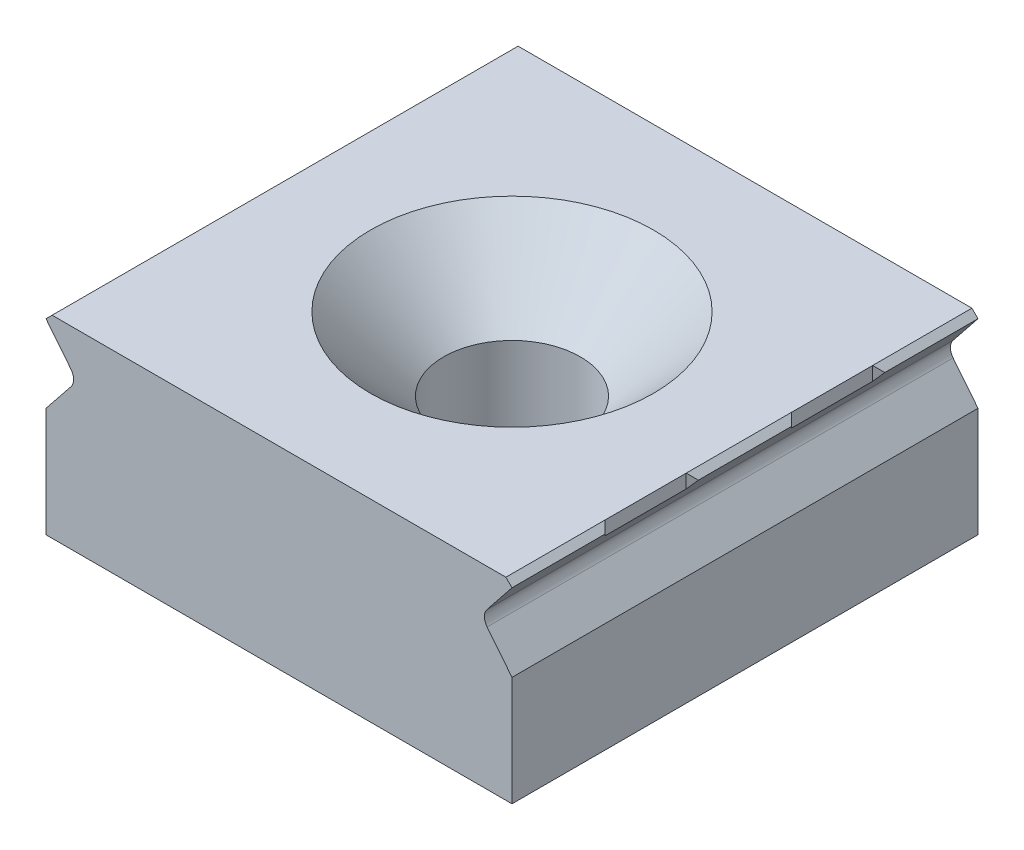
from build123d import *

# Parameters (mm, degrees)
SKETCH1_W           = 19.1
SKETCH1_H           = 19.1
BOSS_EXTRUDE1_DEPTH = 3.96
CHAMFER1_SIZE       = 0.25
CUT_EXTRUDE1_DEPTH  = 19.1
CUT_EXTRUDE2_DEPTH  = 1
LPATTERN1_COUNT     = 2
LPATTERN1_PITCH     = 7.64
SKETCH4_R           = 2.8
CUT_EXTRUDE3_DEPTH  = 7.92
CHAMFER2_SIZE       = 3


with BuildPart() as part:
    # Sketch1 → Boss-Extrude1 (new, symmetric)
    with BuildSketch(Plane(origin=(0, 0, 0), x_dir=(1, 0, 0), z_dir=(0, 1, 0))):
        Rectangle(SKETCH1_W, SKETCH1_H)
    extrude(amount=BOSS_EXTRUDE1_DEPTH, both=True)

    # Chamfer1
    chamfer1_edges = [part.edges().sort_by_distance(p)[0] for p in [
        (9.55, 3.96, 0),
        (-9.55, 3.96, 0),
    ]]
    chamfer(chamfer1_edges, length=CHAMFER1_SIZE)

    # Sketch2 → Cut-Extrude1 (cut)
    with BuildSketch(Plane.XY.offset(9.55)):
        with BuildLine():
            Line((-9.55, 3.71), (-9.55, 0.53))
            Line((-9.55, 0.53), (-8.529245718, 1.807952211))
            ThreePointArc((-8.529245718, 1.807952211), (-8.419919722, 2.12), (-8.529245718, 2.432047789))
            Line((-8.529245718, 2.432047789), (-9.55, 3.71))
        make_face()
    cut_extrude1 = extrude(amount=-CUT_EXTRUDE1_DEPTH, mode=Mode.SUBTRACT)

    # Mirror1: Cut-Extrude1 across plane
    add(cut_extrude1.mirror(Plane(origin=(0, 0, 0), x_dir=(0, 0, 1), z_dir=(1, 0, 0))), mode=Mode.SUBTRACT)

    # Sketch3 → Cut-Extrude2 (cut)
    with BuildSketch(Plane(origin=(0, 3.96, 0), x_dir=(1, 0, 0), z_dir=(0, 1, 0))):
        Polygon((-9.55, -5.73), (-9.55, -1.91), (-9.3, -2.16), (-9.3, -5.48), align=None)
        Polygon((9.55, -5.73), (9.3, -5.47999989), (9.3, -2.15999989), (9.55, -1.91), align=None)
    cut_extrude2 = extrude(amount=-CUT_EXTRUDE2_DEPTH, mode=Mode.SUBTRACT)

    # LPattern1: Cut-Extrude2 ×2
    with Locations(*[(0, 0, -i * LPATTERN1_PITCH) for i in range(1, LPATTERN1_COUNT)]):
        add(cut_extrude2, mode=Mode.SUBTRACT)

    # Sketch4 → Cut-Extrude3 (cut)
    with BuildSketch(Plane(origin=(0, 3.96, 0), x_dir=(1, 0, 0), z_dir=(0, 1, 0))):
        with Locations(Location((0, 0, 0), (0, 0, 270))):
            Circle(SKETCH4_R)
    extrude(amount=-CUT_EXTRUDE3_DEPTH, mode=Mode.SUBTRACT)

    # Chamfer2
    chamfer2_edges = [part.edges().sort_by_distance(p)[0] for p in [
        (0, 3.96, -2.8),
    ]]
    chamfer(chamfer2_edges, length=CHAMFER2_SIZE)


solid = part.part
